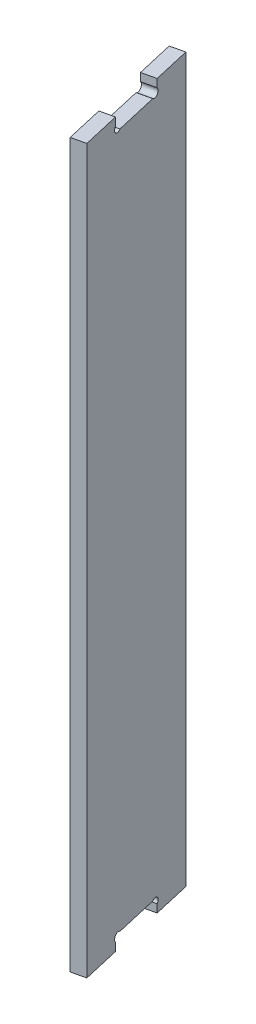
ISO-10303-21;
HEADER;
FILE_DESCRIPTION(('STEP AP214'),'2;1');
FILE_NAME('part.step','',(''),(''),'','','');
FILE_SCHEMA(('AUTOMOTIVE_DESIGN { 1 0 10303 214 1 1 1 1 }'));
ENDSEC;
DATA;
#1=APPLICATION_CONTEXT('core data for automotive mechanical design processes');
#2=APPLICATION_PROTOCOL_DEFINITION('international standard','automotive_design',2000,#1);
#3=PRODUCT_CONTEXT('',#1,'mechanical');
#4=PRODUCT('Part','Part','',(#3));
#5=PRODUCT_RELATED_PRODUCT_CATEGORY('part','',(#4));
#6=PRODUCT_DEFINITION_FORMATION('','',#4);
#7=PRODUCT_DEFINITION_CONTEXT('part definition',#1,'design');
#8=PRODUCT_DEFINITION('design','',#6,#7);
#9=PRODUCT_DEFINITION_SHAPE('','',#8);
#10=(LENGTH_UNIT() NAMED_UNIT(*) SI_UNIT(.MILLI.,.METRE.));
#11=(NAMED_UNIT(*) PLANE_ANGLE_UNIT() SI_UNIT($,.RADIAN.));
#12=(NAMED_UNIT(*) SI_UNIT($,.STERADIAN.) SOLID_ANGLE_UNIT());
#13=UNCERTAINTY_MEASURE_WITH_UNIT(LENGTH_MEASURE(1.E-05),#10,'distance_accuracy_value','');
#14=(GEOMETRIC_REPRESENTATION_CONTEXT(3) GLOBAL_UNCERTAINTY_ASSIGNED_CONTEXT((#13)) GLOBAL_UNIT_ASSIGNED_CONTEXT((#10,
#11,#12)) REPRESENTATION_CONTEXT('',''));
#15=CARTESIAN_POINT('',(0.,0.,0.));
#16=DIRECTION('',(0.,0.,1.));
#17=DIRECTION('',(1.,0.,0.));
#18=AXIS2_PLACEMENT_3D('',#15,#16,#17);
#19=CARTESIAN_POINT('',(164.822751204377,500.,638.878970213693));
#20=DIRECTION('',(0.,1.,0.));
#21=DIRECTION('',(-1.,0.,0.));
#22=AXIS2_PLACEMENT_3D('',#19,#20,#21);
#23=PLANE('',#22);
#24=DIRECTION('',(-0.224859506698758,0.,-0.97439119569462));
#25=VECTOR('',#24,1.);
#26=CARTESIAN_POINT('',(390.,500.,0.));
#27=LINE('',#26,#25);
#28=CARTESIAN_POINT('',(404.22401861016,500.,61.6374139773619));
#29=VERTEX_POINT('',#28);
#30=CARTESIAN_POINT('',(397.137634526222,500.,30.9297496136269));
#31=VERTEX_POINT('',#30);
#32=EDGE_CURVE('E247',#29,#31,#27,.T.);
#33=ORIENTED_EDGE('',*,*,#32,.T.);
#34=DIRECTION('',(-0.97439119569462,0.,0.224859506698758));
#35=VECTOR('',#34,1.);
#36=CARTESIAN_POINT('',(417.419204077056,500.,26.2493874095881));
#37=LINE('',#36,#35);
#38=CARTESIAN_POINT('',(387.393722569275,500.,33.1783446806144));
#39=VERTEX_POINT('',#38);
#40=EDGE_CURVE('E158',#31,#39,#37,.T.);
#41=ORIENTED_EDGE('',*,*,#40,.T.);
#42=DIRECTION('',(0.224859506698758,0.,0.97439119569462));
#43=VECTOR('',#42,1.);
#44=CARTESIAN_POINT('',(380.256088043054,500.,2.24859506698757));
#45=LINE('',#44,#43);
#46=CARTESIAN_POINT('',(394.480106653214,500.,63.8860090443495));
#47=VERTEX_POINT('',#46);
#48=EDGE_CURVE('E157',#39,#47,#45,.T.);
#49=ORIENTED_EDGE('',*,*,#48,.T.);
#50=DIRECTION('',(-0.97439119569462,0.,0.224859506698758));
#51=VECTOR('',#50,1.);
#52=CARTESIAN_POINT('',(424.505588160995,500.,56.9570517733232));
#53=LINE('',#52,#51);
#54=EDGE_CURVE('E168',#47,#29,#53,.F.);
#55=ORIENTED_EDGE('',*,*,#54,.T.);
#56=EDGE_LOOP('',(#33,#41,#49,#55));
#57=FACE_BOUND('',#56,.T.);
#58=ADVANCED_FACE('F33',(#57),#23,.T.);
#59=CARTESIAN_POINT('',(405.178016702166,500.,65.7714057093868));
#60=DIRECTION('',(0.224859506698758,0.,0.97439119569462));
#61=DIRECTION('',(0.97439119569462,0.,-0.224859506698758));
#62=AXIS2_PLACEMENT_3D('',#59,#60,#61);
#63=PLANE('',#62);
#64=DIRECTION('',(-0.97439119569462,0.,0.224859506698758));
#65=VECTOR('',#64,1.);
#66=CARTESIAN_POINT('',(425.459586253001,504.242640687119,61.0910435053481));
#67=LINE('',#66,#65);
#68=CARTESIAN_POINT('',(395.43410474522,504.242640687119,68.0200007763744));
#69=VERTEX_POINT('',#68);
#70=CARTESIAN_POINT('',(405.178016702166,504.242640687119,65.7714057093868));
#71=VERTEX_POINT('',#70);
#72=EDGE_CURVE('E11',#69,#71,#67,.F.);
#73=ORIENTED_EDGE('',*,*,#72,.F.);
#74=DIRECTION('',(0.,1.,0.));
#75=VECTOR('',#74,1.);
#76=CARTESIAN_POINT('',(395.43410474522,500.,68.0200007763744));
#77=LINE('',#76,#75);
#78=CARTESIAN_POINT('',(395.43410474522,510.,68.0200007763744));
#79=VERTEX_POINT('',#78);
#80=EDGE_CURVE('E183',#69,#79,#77,.T.);
#81=ORIENTED_EDGE('',*,*,#80,.T.);
#82=DIRECTION('',(-0.97439119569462,0.,0.224859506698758));
#83=VECTOR('',#82,1.);
#84=CARTESIAN_POINT('',(405.178016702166,510.,65.7714057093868));
#85=LINE('',#84,#83);
#86=CARTESIAN_POINT('',(405.178016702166,510.,65.7714057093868));
#87=VERTEX_POINT('',#86);
#88=EDGE_CURVE('E189',#87,#79,#85,.T.);
#89=ORIENTED_EDGE('',*,*,#88,.F.);
#90=DIRECTION('',(0.,1.,0.));
#91=VECTOR('',#90,1.);
#92=CARTESIAN_POINT('',(405.178016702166,500.,65.7714057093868));
#93=LINE('',#92,#91);
#94=EDGE_CURVE('E182',#71,#87,#93,.T.);
#95=ORIENTED_EDGE('',*,*,#94,.F.);
#96=EDGE_LOOP('',(#73,#81,#89,#95));
#97=FACE_BOUND('',#96,.T.);
#98=ADVANCED_FACE('F295',(#97),#63,.F.);
#99=CARTESIAN_POINT('',(396.183636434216,500.,26.795757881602));
#100=DIRECTION('',(-0.224859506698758,0.,-0.97439119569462));
#101=DIRECTION('',(-0.97439119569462,0.,0.224859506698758));
#102=AXIS2_PLACEMENT_3D('',#99,#100,#101);
#103=PLANE('',#102);
#104=DIRECTION('',(-0.97439119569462,0.,0.224859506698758));
#105=VECTOR('',#104,1.);
#106=CARTESIAN_POINT('',(416.46520598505,504.242640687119,22.1153956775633));
#107=LINE('',#106,#105);
#108=CARTESIAN_POINT('',(396.183636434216,504.242640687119,26.795757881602));
#109=VERTEX_POINT('',#108);
#110=CARTESIAN_POINT('',(386.43972447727,504.242640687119,29.0443529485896));
#111=VERTEX_POINT('',#110);
#112=EDGE_CURVE('E40',#109,#111,#107,.T.);
#113=ORIENTED_EDGE('',*,*,#112,.F.);
#114=DIRECTION('',(0.,-1.,0.));
#115=VECTOR('',#114,1.);
#116=CARTESIAN_POINT('',(396.183636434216,500.,26.795757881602));
#117=LINE('',#116,#115);
#118=CARTESIAN_POINT('',(396.183636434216,510.,26.795757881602));
#119=VERTEX_POINT('',#118);
#120=EDGE_CURVE('E166',#119,#109,#117,.T.);
#121=ORIENTED_EDGE('',*,*,#120,.F.);
#122=DIRECTION('',(-0.97439119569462,0.,0.224859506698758));
#123=VECTOR('',#122,1.);
#124=CARTESIAN_POINT('',(396.183636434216,510.,26.795757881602));
#125=LINE('',#124,#123);
#126=CARTESIAN_POINT('',(386.43972447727,510.,29.0443529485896));
#127=VERTEX_POINT('',#126);
#128=EDGE_CURVE('E163',#119,#127,#125,.T.);
#129=ORIENTED_EDGE('',*,*,#128,.T.);
#130=DIRECTION('',(0.,-1.,0.));
#131=VECTOR('',#130,1.);
#132=CARTESIAN_POINT('',(386.43972447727,500.,29.0443529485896));
#133=LINE('',#132,#131);
#134=EDGE_CURVE('E155',#127,#111,#133,.T.);
#135=ORIENTED_EDGE('',*,*,#134,.T.);
#136=EDGE_LOOP('',(#113,#121,#129,#135));
#137=FACE_BOUND('',#136,.T.);
#138=ADVANCED_FACE('F161',(#137),#103,.F.);
#139=CARTESIAN_POINT('',(390.,599.787695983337,0.));
#140=DIRECTION('',(0.224859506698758,0.,0.97439119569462));
#141=DIRECTION('',(0.97439119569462,0.,-0.224859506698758));
#142=AXIS2_PLACEMENT_3D('',#139,#140,#141);
#143=PLANE('',#142);
#144=DIRECTION('',(0.,-1.,0.));
#145=VECTOR('',#144,1.);
#146=CARTESIAN_POINT('',(380.256088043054,599.787695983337,2.24859506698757));
#147=LINE('',#146,#145);
#148=CARTESIAN_POINT('',(380.256088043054,510.,2.24859506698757));
#149=VERTEX_POINT('',#148);
#150=CARTESIAN_POINT('',(380.256088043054,-10.,2.24859506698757));
#151=VERTEX_POINT('',#150);
#152=EDGE_CURVE('E253',#149,#151,#147,.T.);
#153=ORIENTED_EDGE('',*,*,#152,.F.);
#154=DIRECTION('',(-0.97439119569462,0.,0.224859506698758));
#155=VECTOR('',#154,1.);
#156=CARTESIAN_POINT('',(390.,510.,0.));
#157=LINE('',#156,#155);
#158=CARTESIAN_POINT('',(390.,510.,0.));
#159=VERTEX_POINT('',#158);
#160=EDGE_CURVE('E174',#159,#149,#157,.T.);
#161=ORIENTED_EDGE('',*,*,#160,.F.);
#162=DIRECTION('',(0.,-1.,0.));
#163=VECTOR('',#162,1.);
#164=CARTESIAN_POINT('',(390.,599.787695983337,0.));
#165=LINE('',#164,#163);
#166=CARTESIAN_POINT('',(390.,-10.,0.));
#167=VERTEX_POINT('',#166);
#168=EDGE_CURVE('E241',#159,#167,#165,.T.);
#169=ORIENTED_EDGE('',*,*,#168,.T.);
#170=DIRECTION('',(-0.97439119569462,0.,0.224859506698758));
#171=VECTOR('',#170,1.);
#172=CARTESIAN_POINT('',(390.,-10.,0.));
#173=LINE('',#172,#171);
#174=EDGE_CURVE('E218',#167,#151,#173,.T.);
#175=ORIENTED_EDGE('',*,*,#174,.T.);
#176=EDGE_LOOP('',(#153,#161,#169,#175));
#177=FACE_BOUND('',#176,.T.);
#178=ADVANCED_FACE('F312',(#177),#143,.F.);
#179=CARTESIAN_POINT('',(380.256088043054,599.787695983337,2.24859506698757));
#180=DIRECTION('',(0.97439119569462,0.,-0.224859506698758));
#181=DIRECTION('',(-0.224859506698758,0.,-0.97439119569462));
#182=AXIS2_PLACEMENT_3D('',#179,#180,#181);
#183=PLANE('',#182);
#184=ORIENTED_EDGE('',*,*,#48,.F.);
#185=CARTESIAN_POINT('',(386.916723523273,502.12132034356,31.111348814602));
#186=DIRECTION('',(0.97439119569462,0.,-0.224859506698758));
#187=DIRECTION('',(-0.224859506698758,0.,-0.97439119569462));
#188=AXIS2_PLACEMENT_3D('',#185,#186,#187);
#189=CIRCLE('',#188,3.00000000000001);
#190=EDGE_CURVE('E143',#111,#39,#189,.F.);
#191=ORIENTED_EDGE('',*,*,#190,.F.);
#192=ORIENTED_EDGE('',*,*,#134,.F.);
#193=DIRECTION('',(0.224859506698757,0.,0.97439119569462));
#194=VECTOR('',#193,1.);
#195=CARTESIAN_POINT('',(380.256088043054,510.,2.24859506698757));
#196=LINE('',#195,#194);
#197=EDGE_CURVE('E164',#149,#127,#196,.T.);
#198=ORIENTED_EDGE('',*,*,#197,.F.);
#199=ORIENTED_EDGE('',*,*,#152,.T.);
#200=DIRECTION('',(0.224859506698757,0.,0.97439119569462));
#201=VECTOR('',#200,1.);
#202=CARTESIAN_POINT('',(380.256088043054,-10.,2.24859506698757));
#203=LINE('',#202,#201);
#204=CARTESIAN_POINT('',(386.43972447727,-10.,29.0443529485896));
#205=VERTEX_POINT('',#204);
#206=EDGE_CURVE('E208',#151,#205,#203,.T.);
#207=ORIENTED_EDGE('',*,*,#206,.T.);
#208=DIRECTION('',(0.,1.,0.));
#209=VECTOR('',#208,1.);
#210=CARTESIAN_POINT('',(386.43972447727,0.,29.0443529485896));
#211=LINE('',#210,#209);
#212=CARTESIAN_POINT('',(386.43972447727,-4.24264068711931,29.0443529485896));
#213=VERTEX_POINT('',#212);
#214=EDGE_CURVE('E215',#205,#213,#211,.T.);
#215=ORIENTED_EDGE('',*,*,#214,.T.);
#216=CARTESIAN_POINT('',(386.916723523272,-2.12132034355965,31.111348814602));
#217=DIRECTION('',(0.97439119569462,0.,-0.224859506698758));
#218=DIRECTION('',(-0.224859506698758,0.,-0.97439119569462));
#219=AXIS2_PLACEMENT_3D('',#216,#217,#218);
#220=CIRCLE('',#219,3.00000000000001);
#221=CARTESIAN_POINT('',(387.393722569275,0.,33.1783446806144));
#222=VERTEX_POINT('',#221);
#223=EDGE_CURVE('E196',#213,#222,#220,.T.);
#224=ORIENTED_EDGE('',*,*,#223,.T.);
#225=DIRECTION('',(0.224859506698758,0.,0.97439119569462));
#226=VECTOR('',#225,1.);
#227=CARTESIAN_POINT('',(380.256088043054,0.,2.24859506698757));
#228=LINE('',#227,#226);
#229=CARTESIAN_POINT('',(394.480106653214,0.,63.8860090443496));
#230=VERTEX_POINT('',#229);
#231=EDGE_CURVE('E249',#222,#230,#228,.T.);
#232=ORIENTED_EDGE('',*,*,#231,.T.);
#233=CARTESIAN_POINT('',(394.957105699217,-2.12132034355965,65.9530049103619));
#234=DIRECTION('',(0.97439119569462,0.,-0.224859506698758));
#235=DIRECTION('',(-0.224859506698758,0.,-0.97439119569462));
#236=AXIS2_PLACEMENT_3D('',#233,#234,#235);
#237=CIRCLE('',#236,2.99999999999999);
#238=CARTESIAN_POINT('',(395.43410474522,-4.24264068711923,68.0200007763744));
#239=VERTEX_POINT('',#238);
#240=EDGE_CURVE('E206',#230,#239,#237,.T.);
#241=ORIENTED_EDGE('',*,*,#240,.T.);
#242=DIRECTION('',(0.,-1.,0.));
#243=VECTOR('',#242,1.);
#244=CARTESIAN_POINT('',(395.43410474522,0.,68.0200007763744));
#245=LINE('',#244,#243);
#246=CARTESIAN_POINT('',(395.43410474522,-10.,68.0200007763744));
#247=VERTEX_POINT('',#246);
#248=EDGE_CURVE('E225',#239,#247,#245,.T.);
#249=ORIENTED_EDGE('',*,*,#248,.T.);
#250=DIRECTION('',(0.224859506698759,0.,0.97439119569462));
#251=VECTOR('',#250,1.);
#252=CARTESIAN_POINT('',(401.617741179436,-10.,94.8157586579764));
#253=LINE('',#252,#251);
#254=CARTESIAN_POINT('',(401.617741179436,-10.,94.8157586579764));
#255=VERTEX_POINT('',#254);
#256=EDGE_CURVE('E231',#247,#255,#253,.T.);
#257=ORIENTED_EDGE('',*,*,#256,.T.);
#258=DIRECTION('',(0.,-1.,0.));
#259=VECTOR('',#258,1.);
#260=CARTESIAN_POINT('',(401.617741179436,599.787695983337,94.8157586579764));
#261=LINE('',#260,#259);
#262=CARTESIAN_POINT('',(401.617741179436,510.,94.8157586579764));
#263=VERTEX_POINT('',#262);
#264=EDGE_CURVE('E252',#263,#255,#261,.T.);
#265=ORIENTED_EDGE('',*,*,#264,.F.);
#266=DIRECTION('',(0.224859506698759,0.,0.97439119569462));
#267=VECTOR('',#266,1.);
#268=CARTESIAN_POINT('',(401.617741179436,510.,94.8157586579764));
#269=LINE('',#268,#267);
#270=EDGE_CURVE('E177',#79,#263,#269,.T.);
#271=ORIENTED_EDGE('',*,*,#270,.F.);
#272=ORIENTED_EDGE('',*,*,#80,.F.);
#273=CARTESIAN_POINT('',(394.957105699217,502.12132034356,65.9530049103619));
#274=DIRECTION('',(0.97439119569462,0.,-0.224859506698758));
#275=DIRECTION('',(-0.224859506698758,0.,-0.97439119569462));
#276=AXIS2_PLACEMENT_3D('',#273,#274,#275);
#277=CIRCLE('',#276,2.99999999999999);
#278=EDGE_CURVE('E46',#47,#69,#277,.F.);
#279=ORIENTED_EDGE('',*,*,#278,.F.);
#280=EDGE_LOOP('',(#184,#191,#192,#198,#199,#207,#215,#224,#232,#241,#249,#257,#265,#271,#272,#279));
#281=FACE_BOUND('',#280,.T.);
#282=ADVANCED_FACE('F153',(#281),#183,.F.);
#283=CARTESIAN_POINT('',(411.361653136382,599.787695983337,92.5671635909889));
#284=DIRECTION('',(-0.224859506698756,0.,-0.97439119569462));
#285=DIRECTION('',(-0.974391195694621,0.,0.224859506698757));
#286=AXIS2_PLACEMENT_3D('',#283,#284,#285);
#287=PLANE('',#286);
#288=DIRECTION('',(0.,-1.,0.));
#289=VECTOR('',#288,1.);
#290=CARTESIAN_POINT('',(411.361653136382,599.787695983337,92.5671635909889));
#291=LINE('',#290,#289);
#292=CARTESIAN_POINT('',(411.361653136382,510.,92.5671635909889));
#293=VERTEX_POINT('',#292);
#294=CARTESIAN_POINT('',(411.361653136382,-10.,92.5671635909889));
#295=VERTEX_POINT('',#294);
#296=EDGE_CURVE('E248',#293,#295,#291,.T.);
#297=ORIENTED_EDGE('',*,*,#296,.F.);
#298=DIRECTION('',(-0.97439119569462,0.,0.224859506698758));
#299=VECTOR('',#298,1.);
#300=CARTESIAN_POINT('',(411.361653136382,510.,92.5671635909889));
#301=LINE('',#300,#299);
#302=EDGE_CURVE('E185',#293,#263,#301,.T.);
#303=ORIENTED_EDGE('',*,*,#302,.T.);
#304=ORIENTED_EDGE('',*,*,#264,.T.);
#305=DIRECTION('',(-0.97439119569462,0.,0.224859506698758));
#306=VECTOR('',#305,1.);
#307=CARTESIAN_POINT('',(411.361653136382,-10.,92.5671635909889));
#308=LINE('',#307,#306);
#309=EDGE_CURVE('E238',#295,#255,#308,.T.);
#310=ORIENTED_EDGE('',*,*,#309,.F.);
#311=EDGE_LOOP('',(#297,#303,#304,#310));
#312=FACE_BOUND('',#311,.T.);
#313=ADVANCED_FACE('F285',(#312),#287,.F.);
#314=CARTESIAN_POINT('',(390.,599.787695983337,0.));
#315=DIRECTION('',(-0.97439119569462,0.,0.224859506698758));
#316=DIRECTION('',(0.224859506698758,0.,0.97439119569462));
#317=AXIS2_PLACEMENT_3D('',#314,#315,#316);
#318=PLANE('',#317);
#319=CARTESIAN_POINT('',(396.660635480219,502.12132034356,28.8627537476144));
#320=DIRECTION('',(-0.97439119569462,0.,0.224859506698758));
#321=DIRECTION('',(0.224859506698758,0.,0.97439119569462));
#322=AXIS2_PLACEMENT_3D('',#319,#320,#321);
#323=CIRCLE('',#322,3.00000000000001);
#324=EDGE_CURVE('E54',#31,#109,#323,.F.);
#325=ORIENTED_EDGE('',*,*,#324,.F.);
#326=ORIENTED_EDGE('',*,*,#32,.F.);
#327=CARTESIAN_POINT('',(404.701017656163,502.12132034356,63.7044098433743));
#328=DIRECTION('',(-0.97439119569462,0.,0.224859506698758));
#329=DIRECTION('',(0.224859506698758,0.,0.97439119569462));
#330=AXIS2_PLACEMENT_3D('',#327,#328,#329);
#331=CIRCLE('',#330,2.99999999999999);
#332=EDGE_CURVE('E299',#71,#29,#331,.F.);
#333=ORIENTED_EDGE('',*,*,#332,.F.);
#334=ORIENTED_EDGE('',*,*,#94,.T.);
#335=DIRECTION('',(0.224859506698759,0.,0.97439119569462));
#336=VECTOR('',#335,1.);
#337=CARTESIAN_POINT('',(411.361653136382,510.,92.5671635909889));
#338=LINE('',#337,#336);
#339=EDGE_CURVE('E179',#87,#293,#338,.T.);
#340=ORIENTED_EDGE('',*,*,#339,.T.);
#341=ORIENTED_EDGE('',*,*,#296,.T.);
#342=DIRECTION('',(0.224859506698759,0.,0.97439119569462));
#343=VECTOR('',#342,1.);
#344=CARTESIAN_POINT('',(411.361653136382,-10.,92.5671635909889));
#345=LINE('',#344,#343);
#346=CARTESIAN_POINT('',(405.178016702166,-10.,65.7714057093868));
#347=VERTEX_POINT('',#346);
#348=EDGE_CURVE('E230',#347,#295,#345,.T.);
#349=ORIENTED_EDGE('',*,*,#348,.F.);
#350=DIRECTION('',(0.,-1.,0.));
#351=VECTOR('',#350,1.);
#352=CARTESIAN_POINT('',(405.178016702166,0.,65.7714057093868));
#353=LINE('',#352,#351);
#354=CARTESIAN_POINT('',(405.178016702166,-4.24264068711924,65.7714057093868));
#355=VERTEX_POINT('',#354);
#356=EDGE_CURVE('E228',#355,#347,#353,.T.);
#357=ORIENTED_EDGE('',*,*,#356,.F.);
#358=CARTESIAN_POINT('',(404.701017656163,-2.12132034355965,63.7044098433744));
#359=DIRECTION('',(-0.97439119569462,0.,0.224859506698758));
#360=DIRECTION('',(0.224859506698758,0.,0.97439119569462));
#361=AXIS2_PLACEMENT_3D('',#358,#359,#360);
#362=CIRCLE('',#361,2.99999999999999);
#363=CARTESIAN_POINT('',(404.22401861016,0.,61.637413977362));
#364=VERTEX_POINT('',#363);
#365=EDGE_CURVE('E203',#355,#364,#362,.T.);
#366=ORIENTED_EDGE('',*,*,#365,.T.);
#367=DIRECTION('',(-0.224859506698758,0.,-0.97439119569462));
#368=VECTOR('',#367,1.);
#369=CARTESIAN_POINT('',(390.,0.,0.));
#370=LINE('',#369,#368);
#371=CARTESIAN_POINT('',(397.137634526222,0.,30.9297496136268));
#372=VERTEX_POINT('',#371);
#373=EDGE_CURVE('E244',#364,#372,#370,.T.);
#374=ORIENTED_EDGE('',*,*,#373,.T.);
#375=CARTESIAN_POINT('',(396.660635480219,-2.12132034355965,28.8627537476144));
#376=DIRECTION('',(-0.97439119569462,0.,0.224859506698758));
#377=DIRECTION('',(0.224859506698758,0.,0.97439119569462));
#378=AXIS2_PLACEMENT_3D('',#375,#376,#377);
#379=CIRCLE('',#378,3.00000000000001);
#380=CARTESIAN_POINT('',(396.183636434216,-4.24264068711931,26.795757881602));
#381=VERTEX_POINT('',#380);
#382=EDGE_CURVE('E192',#372,#381,#379,.T.);
#383=ORIENTED_EDGE('',*,*,#382,.T.);
#384=DIRECTION('',(0.,1.,0.));
#385=VECTOR('',#384,1.);
#386=CARTESIAN_POINT('',(396.183636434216,0.,26.795757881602));
#387=LINE('',#386,#385);
#388=CARTESIAN_POINT('',(396.183636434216,-10.,26.795757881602));
#389=VERTEX_POINT('',#388);
#390=EDGE_CURVE('E214',#389,#381,#387,.T.);
#391=ORIENTED_EDGE('',*,*,#390,.F.);
#392=DIRECTION('',(0.224859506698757,0.,0.97439119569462));
#393=VECTOR('',#392,1.);
#394=CARTESIAN_POINT('',(390.,-10.,0.));
#395=LINE('',#394,#393);
#396=EDGE_CURVE('E211',#167,#389,#395,.T.);
#397=ORIENTED_EDGE('',*,*,#396,.F.);
#398=ORIENTED_EDGE('',*,*,#168,.F.);
#399=DIRECTION('',(0.224859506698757,0.,0.97439119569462));
#400=VECTOR('',#399,1.);
#401=CARTESIAN_POINT('',(390.,510.,0.));
#402=LINE('',#401,#400);
#403=EDGE_CURVE('E171',#159,#119,#402,.T.);
#404=ORIENTED_EDGE('',*,*,#403,.T.);
#405=ORIENTED_EDGE('',*,*,#120,.T.);
#406=EDGE_LOOP('',(#325,#326,#333,#334,#340,#341,#349,#357,#366,#374,#383,#391,#397,#398,#404,#405));
#407=FACE_BOUND('',#406,.T.);
#408=ADVANCED_FACE('F279',(#407),#318,.F.);
#409=CARTESIAN_POINT('',(0.,0.,0.));
#410=DIRECTION('',(0.,1.,0.));
#411=DIRECTION('',(0.,0.,1.));
#412=AXIS2_PLACEMENT_3D('',#409,#410,#411);
#413=PLANE('',#412);
#414=ORIENTED_EDGE('',*,*,#231,.F.);
#415=DIRECTION('',(-0.97439119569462,0.,0.224859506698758));
#416=VECTOR('',#415,1.);
#417=CARTESIAN_POINT('',(417.419204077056,0.,26.2493874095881));
#418=LINE('',#417,#416);
#419=EDGE_CURVE('E199',#222,#372,#418,.F.);
#420=ORIENTED_EDGE('',*,*,#419,.T.);
#421=ORIENTED_EDGE('',*,*,#373,.F.);
#422=DIRECTION('',(-0.97439119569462,0.,0.224859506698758));
#423=VECTOR('',#422,1.);
#424=CARTESIAN_POINT('',(424.505588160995,0.,56.9570517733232));
#425=LINE('',#424,#423);
#426=EDGE_CURVE('E202',#364,#230,#425,.T.);
#427=ORIENTED_EDGE('',*,*,#426,.T.);
#428=EDGE_LOOP('',(#414,#420,#421,#427));
#429=FACE_BOUND('',#428,.T.);
#430=ADVANCED_FACE('F276',(#429),#413,.F.);
#431=CARTESIAN_POINT('',(411.361653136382,-10.,92.5671635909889));
#432=DIRECTION('',(0.,-1.,0.));
#433=DIRECTION('',(0.,0.,-1.));
#434=AXIS2_PLACEMENT_3D('',#431,#432,#433);
#435=PLANE('',#434);
#436=ORIENTED_EDGE('',*,*,#256,.F.);
#437=DIRECTION('',(-0.97439119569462,0.,0.224859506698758));
#438=VECTOR('',#437,1.);
#439=CARTESIAN_POINT('',(405.178016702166,-10.,65.7714057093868));
#440=LINE('',#439,#438);
#441=EDGE_CURVE('E234',#347,#247,#440,.T.);
#442=ORIENTED_EDGE('',*,*,#441,.F.);
#443=ORIENTED_EDGE('',*,*,#348,.T.);
#444=ORIENTED_EDGE('',*,*,#309,.T.);
#445=EDGE_LOOP('',(#436,#442,#443,#444));
#446=FACE_BOUND('',#445,.T.);
#447=ADVANCED_FACE('F282',(#446),#435,.T.);
#448=CARTESIAN_POINT('',(405.178016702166,0.,65.7714057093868));
#449=DIRECTION('',(-0.224859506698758,0.,-0.97439119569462));
#450=DIRECTION('',(-0.97439119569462,0.,0.224859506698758));
#451=AXIS2_PLACEMENT_3D('',#448,#449,#450);
#452=PLANE('',#451);
#453=DIRECTION('',(-0.97439119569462,0.,0.224859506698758));
#454=VECTOR('',#453,1.);
#455=CARTESIAN_POINT('',(425.459586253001,-4.24264068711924,61.0910435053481));
#456=LINE('',#455,#454);
#457=EDGE_CURVE('E149',#355,#239,#456,.T.);
#458=ORIENTED_EDGE('',*,*,#457,.F.);
#459=ORIENTED_EDGE('',*,*,#356,.T.);
#460=ORIENTED_EDGE('',*,*,#441,.T.);
#461=ORIENTED_EDGE('',*,*,#248,.F.);
#462=EDGE_LOOP('',(#458,#459,#460,#461));
#463=FACE_BOUND('',#462,.T.);
#464=ADVANCED_FACE('F271',(#463),#452,.T.);
#465=CARTESIAN_POINT('',(396.183636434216,0.,26.795757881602));
#466=DIRECTION('',(0.224859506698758,0.,0.97439119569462));
#467=DIRECTION('',(0.97439119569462,0.,-0.224859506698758));
#468=AXIS2_PLACEMENT_3D('',#465,#466,#467);
#469=PLANE('',#468);
#470=DIRECTION('',(-0.97439119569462,0.,0.224859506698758));
#471=VECTOR('',#470,1.);
#472=CARTESIAN_POINT('',(416.46520598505,-4.24264068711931,22.1153956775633));
#473=LINE('',#472,#471);
#474=EDGE_CURVE('E255',#213,#381,#473,.F.);
#475=ORIENTED_EDGE('',*,*,#474,.F.);
#476=ORIENTED_EDGE('',*,*,#214,.F.);
#477=DIRECTION('',(-0.97439119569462,0.,0.224859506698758));
#478=VECTOR('',#477,1.);
#479=CARTESIAN_POINT('',(396.183636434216,-10.,26.795757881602));
#480=LINE('',#479,#478);
#481=EDGE_CURVE('E223',#389,#205,#480,.T.);
#482=ORIENTED_EDGE('',*,*,#481,.F.);
#483=ORIENTED_EDGE('',*,*,#390,.T.);
#484=EDGE_LOOP('',(#475,#476,#482,#483));
#485=FACE_BOUND('',#484,.T.);
#486=ADVANCED_FACE('F319',(#485),#469,.T.);
#487=CARTESIAN_POINT('',(390.,-10.,0.));
#488=DIRECTION('',(0.,-1.,0.));
#489=DIRECTION('',(0.,0.,-1.));
#490=AXIS2_PLACEMENT_3D('',#487,#488,#489);
#491=PLANE('',#490);
#492=ORIENTED_EDGE('',*,*,#206,.F.);
#493=ORIENTED_EDGE('',*,*,#174,.F.);
#494=ORIENTED_EDGE('',*,*,#396,.T.);
#495=ORIENTED_EDGE('',*,*,#481,.T.);
#496=EDGE_LOOP('',(#492,#493,#494,#495));
#497=FACE_BOUND('',#496,.T.);
#498=ADVANCED_FACE('F314',(#497),#491,.T.);
#499=CARTESIAN_POINT('',(416.942205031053,-2.12132034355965,24.1823915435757));
#500=DIRECTION('',(-0.97439119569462,0.,0.224859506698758));
#501=DIRECTION('',(0.224859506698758,0.,0.97439119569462));
#502=AXIS2_PLACEMENT_3D('',#499,#500,#501);
#503=CYLINDRICAL_SURFACE('',#502,3.00000000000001);
#504=ORIENTED_EDGE('',*,*,#382,.F.);
#505=ORIENTED_EDGE('',*,*,#419,.F.);
#506=ORIENTED_EDGE('',*,*,#223,.F.);
#507=ORIENTED_EDGE('',*,*,#474,.T.);
#508=EDGE_LOOP('',(#504,#505,#506,#507));
#509=FACE_BOUND('',#508,.T.);
#510=ADVANCED_FACE('F321',(#509),#503,.F.);
#511=CARTESIAN_POINT('',(424.982587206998,-2.12132034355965,59.0240476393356));
#512=DIRECTION('',(-0.97439119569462,0.,0.224859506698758));
#513=DIRECTION('',(0.224859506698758,0.,0.97439119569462));
#514=AXIS2_PLACEMENT_3D('',#511,#512,#513);
#515=CYLINDRICAL_SURFACE('',#514,2.99999999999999);
#516=ORIENTED_EDGE('',*,*,#426,.F.);
#517=ORIENTED_EDGE('',*,*,#365,.F.);
#518=ORIENTED_EDGE('',*,*,#457,.T.);
#519=ORIENTED_EDGE('',*,*,#240,.F.);
#520=EDGE_LOOP('',(#516,#517,#518,#519));
#521=FACE_BOUND('',#520,.T.);
#522=ADVANCED_FACE('F268',(#521),#515,.F.);
#523=CARTESIAN_POINT('',(411.361653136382,510.,92.5671635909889));
#524=DIRECTION('',(0.,-1.,0.));
#525=DIRECTION('',(0.,0.,-1.));
#526=AXIS2_PLACEMENT_3D('',#523,#524,#525);
#527=PLANE('',#526);
#528=ORIENTED_EDGE('',*,*,#270,.T.);
#529=ORIENTED_EDGE('',*,*,#302,.F.);
#530=ORIENTED_EDGE('',*,*,#339,.F.);
#531=ORIENTED_EDGE('',*,*,#88,.T.);
#532=EDGE_LOOP('',(#528,#529,#530,#531));
#533=FACE_BOUND('',#532,.T.);
#534=ADVANCED_FACE('F290',(#533),#527,.F.);
#535=CARTESIAN_POINT('',(390.,510.,0.));
#536=DIRECTION('',(0.,-1.,0.));
#537=DIRECTION('',(0.,0.,-1.));
#538=AXIS2_PLACEMENT_3D('',#535,#536,#537);
#539=PLANE('',#538);
#540=ORIENTED_EDGE('',*,*,#197,.T.);
#541=ORIENTED_EDGE('',*,*,#128,.F.);
#542=ORIENTED_EDGE('',*,*,#403,.F.);
#543=ORIENTED_EDGE('',*,*,#160,.T.);
#544=EDGE_LOOP('',(#540,#541,#542,#543));
#545=FACE_BOUND('',#544,.T.);
#546=ADVANCED_FACE('F308',(#545),#539,.F.);
#547=CARTESIAN_POINT('',(416.942205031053,502.12132034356,24.1823915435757));
#548=DIRECTION('',(-0.97439119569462,0.,0.224859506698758));
#549=DIRECTION('',(0.224859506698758,0.,0.97439119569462));
#550=AXIS2_PLACEMENT_3D('',#547,#548,#549);
#551=CYLINDRICAL_SURFACE('',#550,3.00000000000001);
#552=ORIENTED_EDGE('',*,*,#190,.T.);
#553=ORIENTED_EDGE('',*,*,#40,.F.);
#554=ORIENTED_EDGE('',*,*,#324,.T.);
#555=ORIENTED_EDGE('',*,*,#112,.T.);
#556=EDGE_LOOP('',(#552,#553,#554,#555));
#557=FACE_BOUND('',#556,.T.);
#558=ADVANCED_FACE('F142',(#557),#551,.F.);
#559=CARTESIAN_POINT('',(424.982587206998,502.12132034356,59.0240476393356));
#560=DIRECTION('',(-0.97439119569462,0.,0.224859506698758));
#561=DIRECTION('',(0.224859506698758,0.,0.97439119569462));
#562=AXIS2_PLACEMENT_3D('',#559,#560,#561);
#563=CYLINDRICAL_SURFACE('',#562,2.99999999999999);
#564=ORIENTED_EDGE('',*,*,#278,.T.);
#565=ORIENTED_EDGE('',*,*,#72,.T.);
#566=ORIENTED_EDGE('',*,*,#332,.T.);
#567=ORIENTED_EDGE('',*,*,#54,.F.);
#568=EDGE_LOOP('',(#564,#565,#566,#567));
#569=FACE_BOUND('',#568,.T.);
#570=ADVANCED_FACE('F348',(#569),#563,.F.);
#571=CLOSED_SHELL('',(#58,#98,#138,#178,#282,#313,#408,#430,#447,#464,#486,#498,#510,#522,#534,
#546,#558,#570));
#572=MANIFOLD_SOLID_BREP('B2',#571);
#573=ADVANCED_BREP_SHAPE_REPRESENTATION('',(#18,#572),#14);
#574=SHAPE_DEFINITION_REPRESENTATION(#9,#573);
ENDSEC;
END-ISO-10303-21;
